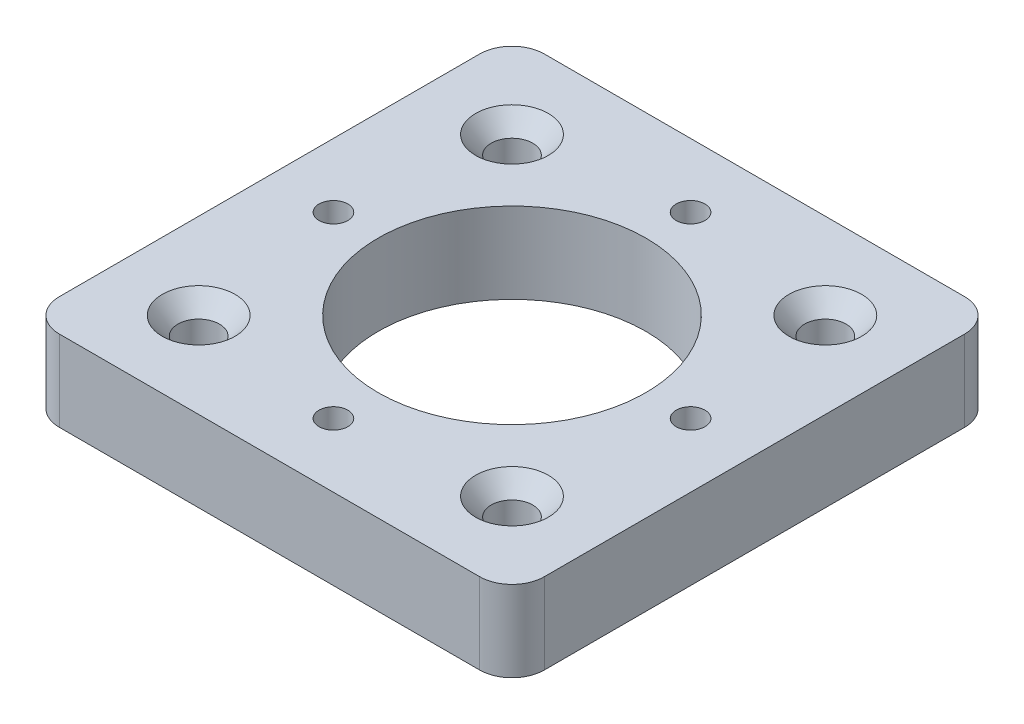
from build123d import *

# Parameters (mm, degrees)
SKETCH1_W                                      = 38.1
SKETCH1_H                                      = 38.1
BOSS_EXTRUDE1_DEPTH                            = 6.35
SKETCH2_R                                      = 10.51687
CUT_EXTRUDE1_DEPTH                             = 28.679008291
CSK_FOR_4_FLAT_HEAD_MACHINE_SCREW1_D           = 3.2639
CSK_FOR_4_FLAT_HEAD_MACHINE_SCREW1_CSINK_D     = 5.715
CSK_FOR_4_FLAT_HEAD_MACHINE_SCREW1_CSINK_ANGLE = 82
F_4_40_TAPPED_HOLE1_D                          = 2.2606
FILLET1_R                                      = 2.54


with BuildPart() as part:
    # Sketch1 → Boss-Extrude1 (new body)
    with BuildSketch(Plane(origin=(0, 0, 0), x_dir=(1, 0, 0), z_dir=(0, 1, 0))):
        Rectangle(SKETCH1_W, SKETCH1_H)
    extrude(amount=BOSS_EXTRUDE1_DEPTH)

    # Sketch2 → Cut-Extrude1 (cut, through all)
    with BuildSketch(Plane(origin=(0, 6.35, 0), x_dir=(1, 0, 0), z_dir=(0, 1, 0))):
        with Locations(Location((0, 0, 0), (0, 0, 270))):
            Circle(SKETCH2_R)
    extrude(amount=-CUT_EXTRUDE1_DEPTH, mode=Mode.SUBTRACT)

    # CSK for _4 Flat Head Machine Screw1 (through all)
    with Locations(Plane(origin=(0, 6.35, 0), x_dir=(1, 0, 0), z_dir=(0, 1, 0))):
        with Locations((-12.3063, 12.3063), (12.3063, 12.3063), (12.3063, -12.3063), (-12.3063, -12.3063), (0, 0)):
            CounterSinkHole(CSK_FOR_4_FLAT_HEAD_MACHINE_SCREW1_D / 2, CSK_FOR_4_FLAT_HEAD_MACHINE_SCREW1_CSINK_D / 2, counter_sink_angle=CSK_FOR_4_FLAT_HEAD_MACHINE_SCREW1_CSINK_ANGLE)

    # 4-40 Tapped Hole1 (through all)
    with Locations(Plane(origin=(0, 6.35, 0), x_dir=(1, 0, 0), z_dir=(0, 1, 0))):
        with Locations((0, 14.027160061), (14.027160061, 0), (0, -14.027160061), (-14.027160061, 0), (0, 0)):
            Hole(F_4_40_TAPPED_HOLE1_D / 2)

    # Fillet1
    fillet1_edges = [part.edges().sort_by_distance(p)[0] for p in [
        (19.05, 3.175, 19.05),
        (-19.05, 3.175, 19.05),
        (-19.05, 3.175, -19.05),
        (19.05, 3.175, -19.05),
    ]]
    fillet(fillet1_edges, radius=FILLET1_R)


solid = part.part
